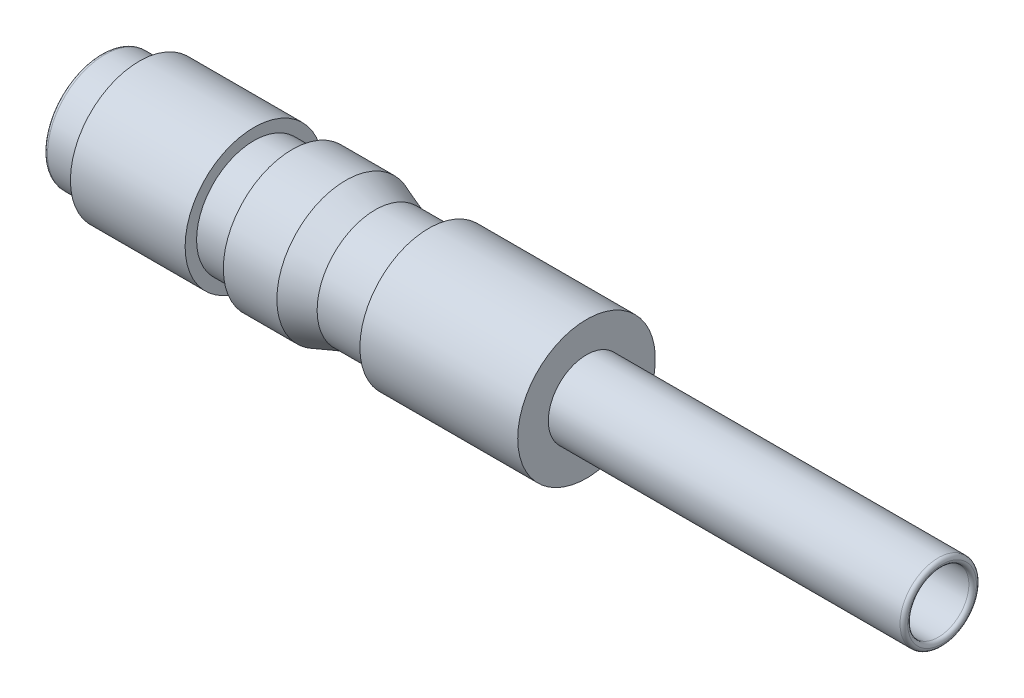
ISO-10303-21;
HEADER;
FILE_DESCRIPTION(('STEP AP214'),'2;1');
FILE_NAME('part.step','',(''),(''),'','','');
FILE_SCHEMA(('AUTOMOTIVE_DESIGN { 1 0 10303 214 1 1 1 1 }'));
ENDSEC;
DATA;
#1=APPLICATION_CONTEXT('core data for automotive mechanical design processes');
#2=APPLICATION_PROTOCOL_DEFINITION('international standard','automotive_design',2000,#1);
#3=PRODUCT_CONTEXT('',#1,'mechanical');
#4=PRODUCT('Part','Part','',(#3));
#5=PRODUCT_RELATED_PRODUCT_CATEGORY('part','',(#4));
#6=PRODUCT_DEFINITION_FORMATION('','',#4);
#7=PRODUCT_DEFINITION_CONTEXT('part definition',#1,'design');
#8=PRODUCT_DEFINITION('design','',#6,#7);
#9=PRODUCT_DEFINITION_SHAPE('','',#8);
#10=(LENGTH_UNIT() NAMED_UNIT(*) SI_UNIT(.MILLI.,.METRE.));
#11=(NAMED_UNIT(*) PLANE_ANGLE_UNIT() SI_UNIT($,.RADIAN.));
#12=(NAMED_UNIT(*) SI_UNIT($,.STERADIAN.) SOLID_ANGLE_UNIT());
#13=UNCERTAINTY_MEASURE_WITH_UNIT(LENGTH_MEASURE(1.E-05),#10,'distance_accuracy_value','');
#14=(GEOMETRIC_REPRESENTATION_CONTEXT(3) GLOBAL_UNCERTAINTY_ASSIGNED_CONTEXT((#13)) GLOBAL_UNIT_ASSIGNED_CONTEXT((#10,
#11,#12)) REPRESENTATION_CONTEXT('',''));
#15=CARTESIAN_POINT('',(0.,0.,0.));
#16=DIRECTION('',(0.,0.,1.));
#17=DIRECTION('',(1.,0.,0.));
#18=AXIS2_PLACEMENT_3D('',#15,#16,#17);
#19=CARTESIAN_POINT('',(5.,0.,0.));
#20=DIRECTION('',(1.,0.,0.));
#21=DIRECTION('',(0.,0.,-1.));
#22=AXIS2_PLACEMENT_3D('',#19,#20,#21);
#23=CYLINDRICAL_SURFACE('',#22,0.4);
#24=CARTESIAN_POINT('',(10.95,0.,0.));
#25=DIRECTION('',(-1.,0.,0.));
#26=DIRECTION('',(0.,0.,1.));
#27=AXIS2_PLACEMENT_3D('',#24,#25,#26);
#28=CIRCLE('',#27,0.4);
#29=CARTESIAN_POINT('',(10.95,0.,0.4));
#30=VERTEX_POINT('',#29);
#31=EDGE_CURVE('E60',#30,#30,#28,.F.);
#32=ORIENTED_EDGE('',*,*,#31,.T.);
#33=EDGE_LOOP('',(#32));
#34=FACE_BOUND('',#33,.T.);
#35=CARTESIAN_POINT('',(6.,0.,0.));
#36=DIRECTION('',(-1.,0.,0.));
#37=DIRECTION('',(0.,0.,1.));
#38=AXIS2_PLACEMENT_3D('',#35,#36,#37);
#39=CIRCLE('',#38,0.4);
#40=CARTESIAN_POINT('',(6.,0.,0.4));
#41=VERTEX_POINT('',#40);
#42=EDGE_CURVE('E64',#41,#41,#39,.F.);
#43=ORIENTED_EDGE('',*,*,#42,.F.);
#44=EDGE_LOOP('',(#43));
#45=FACE_BOUND('',#44,.T.);
#46=ADVANCED_FACE('F33',(#34,#45),#23,.F.);
#47=CARTESIAN_POINT('',(0.,0.,0.));
#48=DIRECTION('',(1.,0.,0.));
#49=DIRECTION('',(0.,0.,-1.));
#50=AXIS2_PLACEMENT_3D('',#47,#48,#49);
#51=PLANE('',#50);
#52=CARTESIAN_POINT('',(0.,0.,0.));
#53=DIRECTION('',(1.,0.,0.));
#54=DIRECTION('',(0.,0.,-1.));
#55=AXIS2_PLACEMENT_3D('',#52,#53,#54);
#56=CIRCLE('',#55,0.699999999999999);
#57=CARTESIAN_POINT('',(0.,0.,-0.699999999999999));
#58=VERTEX_POINT('',#57);
#59=EDGE_CURVE('E40',#58,#58,#56,.F.);
#60=ORIENTED_EDGE('',*,*,#59,.T.);
#61=EDGE_LOOP('',(#60));
#62=FACE_BOUND('',#61,.T.);
#63=CARTESIAN_POINT('',(0.,0.,0.));
#64=DIRECTION('',(-1.,0.,0.));
#65=DIRECTION('',(0.,0.,1.));
#66=AXIS2_PLACEMENT_3D('',#63,#64,#65);
#67=CIRCLE('',#66,0.6);
#68=CARTESIAN_POINT('',(0.,0.,0.6));
#69=VERTEX_POINT('',#68);
#70=EDGE_CURVE('E57',#69,#69,#67,.T.);
#71=ORIENTED_EDGE('',*,*,#70,.F.);
#72=EDGE_LOOP('',(#71));
#73=FACE_BOUND('',#72,.T.);
#74=ADVANCED_FACE('F115',(#62,#73),#51,.F.);
#75=CARTESIAN_POINT('',(-4.99745454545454,0.,0.));
#76=DIRECTION('',(-1.,0.,0.));
#77=DIRECTION('',(0.,0.,1.));
#78=AXIS2_PLACEMENT_3D('',#75,#76,#77);
#79=CYLINDRICAL_SURFACE('',#78,0.749999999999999);
#80=CARTESIAN_POINT('',(0.0499999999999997,0.,0.));
#81=DIRECTION('',(1.,0.,0.));
#82=DIRECTION('',(0.,0.,-1.));
#83=AXIS2_PLACEMENT_3D('',#80,#81,#82);
#84=CIRCLE('',#83,0.749999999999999);
#85=CARTESIAN_POINT('',(0.0499999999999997,0.,-0.749999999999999));
#86=VERTEX_POINT('',#85);
#87=EDGE_CURVE('E10',#86,#86,#84,.T.);
#88=ORIENTED_EDGE('',*,*,#87,.T.);
#89=EDGE_LOOP('',(#88));
#90=FACE_BOUND('',#89,.T.);
#91=CARTESIAN_POINT('',(0.45,0.,0.));
#92=DIRECTION('',(1.,0.,0.));
#93=DIRECTION('',(0.,0.,-1.));
#94=AXIS2_PLACEMENT_3D('',#91,#92,#93);
#95=CIRCLE('',#94,0.749999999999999);
#96=CARTESIAN_POINT('',(0.45,0.,-0.749999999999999));
#97=VERTEX_POINT('',#96);
#98=EDGE_CURVE('E48',#97,#97,#95,.F.);
#99=ORIENTED_EDGE('',*,*,#98,.T.);
#100=EDGE_LOOP('',(#99));
#101=FACE_BOUND('',#100,.T.);
#102=ADVANCED_FACE('F117',(#90,#101),#79,.T.);
#103=CARTESIAN_POINT('',(0.5,0.749999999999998,0.));
#104=DIRECTION('',(1.,0.,0.));
#105=DIRECTION('',(0.,0.,-1.));
#106=AXIS2_PLACEMENT_3D('',#103,#104,#105);
#107=PLANE('',#106);
#108=CARTESIAN_POINT('',(0.5,0.,0.));
#109=DIRECTION('',(1.,0.,0.));
#110=DIRECTION('',(0.,0.,-1.));
#111=AXIS2_PLACEMENT_3D('',#108,#109,#110);
#112=CIRCLE('',#111,0.799999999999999);
#113=CARTESIAN_POINT('',(0.5,0.,-0.799999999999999));
#114=VERTEX_POINT('',#113);
#115=EDGE_CURVE('E44',#114,#114,#112,.T.);
#116=ORIENTED_EDGE('',*,*,#115,.T.);
#117=EDGE_LOOP('',(#116));
#118=FACE_BOUND('',#117,.T.);
#119=CARTESIAN_POINT('',(0.5,0.,0.));
#120=DIRECTION('',(-1.,0.,0.));
#121=DIRECTION('',(0.,0.,1.));
#122=AXIS2_PLACEMENT_3D('',#119,#120,#121);
#123=CIRCLE('',#122,0.899999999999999);
#124=CARTESIAN_POINT('',(0.5,0.,0.899999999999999));
#125=VERTEX_POINT('',#124);
#126=EDGE_CURVE('E63',#125,#125,#123,.T.);
#127=ORIENTED_EDGE('',*,*,#126,.T.);
#128=EDGE_LOOP('',(#127));
#129=FACE_BOUND('',#128,.T.);
#130=ADVANCED_FACE('F123',(#118,#129),#107,.F.);
#131=CARTESIAN_POINT('',(-4.99745454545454,0.,0.));
#132=DIRECTION('',(-1.,0.,0.));
#133=DIRECTION('',(0.,0.,1.));
#134=AXIS2_PLACEMENT_3D('',#131,#132,#133);
#135=CYLINDRICAL_SURFACE('',#134,0.899999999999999);
#136=ORIENTED_EDGE('',*,*,#126,.F.);
#137=EDGE_LOOP('',(#136));
#138=FACE_BOUND('',#137,.T.);
#139=CARTESIAN_POINT('',(2.,0.,0.));
#140=DIRECTION('',(-1.,0.,0.));
#141=DIRECTION('',(0.,0.,1.));
#142=AXIS2_PLACEMENT_3D('',#139,#140,#141);
#143=CIRCLE('',#142,0.899999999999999);
#144=CARTESIAN_POINT('',(2.,0.,0.899999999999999));
#145=VERTEX_POINT('',#144);
#146=EDGE_CURVE('E71',#145,#145,#143,.T.);
#147=ORIENTED_EDGE('',*,*,#146,.T.);
#148=EDGE_LOOP('',(#147));
#149=FACE_BOUND('',#148,.T.);
#150=ADVANCED_FACE('F149',(#138,#149),#135,.T.);
#151=CARTESIAN_POINT('',(2.,0.899999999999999,0.));
#152=DIRECTION('',(-1.,0.,0.));
#153=DIRECTION('',(0.,0.,1.));
#154=AXIS2_PLACEMENT_3D('',#151,#152,#153);
#155=PLANE('',#154);
#156=ORIENTED_EDGE('',*,*,#146,.F.);
#157=EDGE_LOOP('',(#156));
#158=FACE_BOUND('',#157,.T.);
#159=CARTESIAN_POINT('',(2.,0.,0.));
#160=DIRECTION('',(-1.,0.,0.));
#161=DIRECTION('',(0.,0.,1.));
#162=AXIS2_PLACEMENT_3D('',#159,#160,#161);
#163=CIRCLE('',#162,0.749999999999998);
#164=CARTESIAN_POINT('',(2.,0.,0.749999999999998));
#165=VERTEX_POINT('',#164);
#166=EDGE_CURVE('E74',#165,#165,#163,.T.);
#167=ORIENTED_EDGE('',*,*,#166,.T.);
#168=EDGE_LOOP('',(#167));
#169=FACE_BOUND('',#168,.T.);
#170=ADVANCED_FACE('F154',(#158,#169),#155,.F.);
#171=CARTESIAN_POINT('',(-4.99745454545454,0.,0.));
#172=DIRECTION('',(-1.,0.,0.));
#173=DIRECTION('',(0.,0.,1.));
#174=AXIS2_PLACEMENT_3D('',#171,#172,#173);
#175=CYLINDRICAL_SURFACE('',#174,0.749999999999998);
#176=ORIENTED_EDGE('',*,*,#166,.F.);
#177=EDGE_LOOP('',(#176));
#178=FACE_BOUND('',#177,.T.);
#179=CARTESIAN_POINT('',(2.5,0.,0.));
#180=DIRECTION('',(-1.,0.,0.));
#181=DIRECTION('',(0.,0.,1.));
#182=AXIS2_PLACEMENT_3D('',#179,#180,#181);
#183=CIRCLE('',#182,0.749999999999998);
#184=CARTESIAN_POINT('',(2.5,0.,0.749999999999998));
#185=VERTEX_POINT('',#184);
#186=EDGE_CURVE('E77',#185,#185,#183,.T.);
#187=ORIENTED_EDGE('',*,*,#186,.T.);
#188=EDGE_LOOP('',(#187));
#189=FACE_BOUND('',#188,.T.);
#190=ADVANCED_FACE('F160',(#178,#189),#175,.T.);
#191=CARTESIAN_POINT('',(2.5,0.749999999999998,0.));
#192=DIRECTION('',(1.,0.,0.));
#193=DIRECTION('',(0.,0.,-1.));
#194=AXIS2_PLACEMENT_3D('',#191,#192,#193);
#195=PLANE('',#194);
#196=ORIENTED_EDGE('',*,*,#186,.F.);
#197=EDGE_LOOP('',(#196));
#198=FACE_BOUND('',#197,.T.);
#199=CARTESIAN_POINT('',(2.5,0.,0.));
#200=DIRECTION('',(-1.,0.,0.));
#201=DIRECTION('',(0.,0.,1.));
#202=AXIS2_PLACEMENT_3D('',#199,#200,#201);
#203=CIRCLE('',#202,0.899999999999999);
#204=CARTESIAN_POINT('',(2.5,0.,0.899999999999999));
#205=VERTEX_POINT('',#204);
#206=EDGE_CURVE('E80',#205,#205,#203,.T.);
#207=ORIENTED_EDGE('',*,*,#206,.T.);
#208=EDGE_LOOP('',(#207));
#209=FACE_BOUND('',#208,.T.);
#210=ADVANCED_FACE('F166',(#198,#209),#195,.F.);
#211=CARTESIAN_POINT('',(-4.99745454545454,0.,0.));
#212=DIRECTION('',(-1.,0.,0.));
#213=DIRECTION('',(0.,0.,1.));
#214=AXIS2_PLACEMENT_3D('',#211,#212,#213);
#215=CYLINDRICAL_SURFACE('',#214,0.899999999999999);
#216=ORIENTED_EDGE('',*,*,#206,.F.);
#217=EDGE_LOOP('',(#216));
#218=FACE_BOUND('',#217,.T.);
#219=CARTESIAN_POINT('',(3.2,0.,0.));
#220=DIRECTION('',(-1.,0.,0.));
#221=DIRECTION('',(0.,0.,1.));
#222=AXIS2_PLACEMENT_3D('',#219,#220,#221);
#223=CIRCLE('',#222,0.899999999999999);
#224=CARTESIAN_POINT('',(3.2,0.,0.899999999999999));
#225=VERTEX_POINT('',#224);
#226=EDGE_CURVE('E83',#225,#225,#223,.T.);
#227=ORIENTED_EDGE('',*,*,#226,.T.);
#228=EDGE_LOOP('',(#227));
#229=FACE_BOUND('',#228,.T.);
#230=ADVANCED_FACE('F172',(#218,#229),#215,.T.);
#231=CARTESIAN_POINT('',(3.58601099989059,0.,0.));
#232=DIRECTION('',(-1.,0.,0.));
#233=DIRECTION('',(0.,0.,1.));
#234=AXIS2_PLACEMENT_3D('',#231,#232,#233);
#235=CONICAL_SURFACE('',#234,0.75950348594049,0.349065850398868);
#236=ORIENTED_EDGE('',*,*,#226,.F.);
#237=EDGE_LOOP('',(#236));
#238=FACE_BOUND('',#237,.T.);
#239=CARTESIAN_POINT('',(3.58601099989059,0.,0.));
#240=DIRECTION('',(-1.,0.,0.));
#241=DIRECTION('',(0.,0.,1.));
#242=AXIS2_PLACEMENT_3D('',#239,#240,#241);
#243=CIRCLE('',#242,0.75950348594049);
#244=CARTESIAN_POINT('',(3.58601099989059,0.,0.75950348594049));
#245=VERTEX_POINT('',#244);
#246=EDGE_CURVE('E86',#245,#245,#243,.T.);
#247=ORIENTED_EDGE('',*,*,#246,.T.);
#248=EDGE_LOOP('',(#247));
#249=FACE_BOUND('',#248,.T.);
#250=ADVANCED_FACE('F178',(#238,#249),#235,.T.);
#251=CARTESIAN_POINT('',(-4.99745454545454,0.,0.));
#252=DIRECTION('',(-1.,0.,0.));
#253=DIRECTION('',(0.,0.,1.));
#254=AXIS2_PLACEMENT_3D('',#251,#252,#253);
#255=CYLINDRICAL_SURFACE('',#254,0.75950348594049);
#256=ORIENTED_EDGE('',*,*,#246,.F.);
#257=EDGE_LOOP('',(#256));
#258=FACE_BOUND('',#257,.T.);
#259=CARTESIAN_POINT('',(4.28601099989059,0.,0.));
#260=DIRECTION('',(-1.,0.,0.));
#261=DIRECTION('',(0.,0.,1.));
#262=AXIS2_PLACEMENT_3D('',#259,#260,#261);
#263=CIRCLE('',#262,0.75950348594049);
#264=CARTESIAN_POINT('',(4.28601099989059,0.,0.75950348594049));
#265=VERTEX_POINT('',#264);
#266=EDGE_CURVE('E89',#265,#265,#263,.T.);
#267=ORIENTED_EDGE('',*,*,#266,.T.);
#268=EDGE_LOOP('',(#267));
#269=FACE_BOUND('',#268,.T.);
#270=ADVANCED_FACE('F184',(#258,#269),#255,.T.);
#271=CARTESIAN_POINT('',(4.28601099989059,0.75950348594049,0.));
#272=DIRECTION('',(1.,0.,0.));
#273=DIRECTION('',(0.,0.,-1.));
#274=AXIS2_PLACEMENT_3D('',#271,#272,#273);
#275=PLANE('',#274);
#276=ORIENTED_EDGE('',*,*,#266,.F.);
#277=EDGE_LOOP('',(#276));
#278=FACE_BOUND('',#277,.T.);
#279=CARTESIAN_POINT('',(4.28601099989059,0.,0.));
#280=DIRECTION('',(-1.,0.,0.));
#281=DIRECTION('',(0.,0.,1.));
#282=AXIS2_PLACEMENT_3D('',#279,#280,#281);
#283=CIRCLE('',#282,0.899999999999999);
#284=CARTESIAN_POINT('',(4.28601099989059,0.,0.899999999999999));
#285=VERTEX_POINT('',#284);
#286=EDGE_CURVE('E92',#285,#285,#283,.T.);
#287=ORIENTED_EDGE('',*,*,#286,.T.);
#288=EDGE_LOOP('',(#287));
#289=FACE_BOUND('',#288,.T.);
#290=ADVANCED_FACE('F190',(#278,#289),#275,.F.);
#291=CARTESIAN_POINT('',(-4.99745454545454,0.,0.));
#292=DIRECTION('',(-1.,0.,0.));
#293=DIRECTION('',(0.,0.,1.));
#294=AXIS2_PLACEMENT_3D('',#291,#292,#293);
#295=CYLINDRICAL_SURFACE('',#294,0.899999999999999);
#296=ORIENTED_EDGE('',*,*,#286,.F.);
#297=EDGE_LOOP('',(#296));
#298=FACE_BOUND('',#297,.T.);
#299=CARTESIAN_POINT('',(6.35,0.,0.));
#300=DIRECTION('',(-1.,0.,0.));
#301=DIRECTION('',(0.,0.,1.));
#302=AXIS2_PLACEMENT_3D('',#299,#300,#301);
#303=CIRCLE('',#302,0.899999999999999);
#304=CARTESIAN_POINT('',(6.35,0.,0.899999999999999));
#305=VERTEX_POINT('',#304);
#306=EDGE_CURVE('E95',#305,#305,#303,.T.);
#307=ORIENTED_EDGE('',*,*,#306,.T.);
#308=EDGE_LOOP('',(#307));
#309=FACE_BOUND('',#308,.T.);
#310=ADVANCED_FACE('F196',(#298,#309),#295,.T.);
#311=CARTESIAN_POINT('',(6.35,0.899999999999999,0.));
#312=DIRECTION('',(-1.,0.,0.));
#313=DIRECTION('',(0.,0.,1.));
#314=AXIS2_PLACEMENT_3D('',#311,#312,#313);
#315=PLANE('',#314);
#316=ORIENTED_EDGE('',*,*,#306,.F.);
#317=EDGE_LOOP('',(#316));
#318=FACE_BOUND('',#317,.T.);
#319=CARTESIAN_POINT('',(6.35,0.,0.));
#320=DIRECTION('',(-1.,0.,0.));
#321=DIRECTION('',(0.,0.,1.));
#322=AXIS2_PLACEMENT_3D('',#319,#320,#321);
#323=CIRCLE('',#322,0.499999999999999);
#324=CARTESIAN_POINT('',(6.35,0.,0.499999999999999));
#325=VERTEX_POINT('',#324);
#326=EDGE_CURVE('E67',#325,#325,#323,.T.);
#327=ORIENTED_EDGE('',*,*,#326,.T.);
#328=EDGE_LOOP('',(#327));
#329=FACE_BOUND('',#328,.T.);
#330=ADVANCED_FACE('F202',(#318,#329),#315,.F.);
#331=CARTESIAN_POINT('',(-4.99745454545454,0.,0.));
#332=DIRECTION('',(-1.,0.,0.));
#333=DIRECTION('',(0.,0.,1.));
#334=AXIS2_PLACEMENT_3D('',#331,#332,#333);
#335=CYLINDRICAL_SURFACE('',#334,0.499999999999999);
#336=CARTESIAN_POINT('',(10.95,0.,0.));
#337=DIRECTION('',(-1.,0.,0.));
#338=DIRECTION('',(0.,0.,1.));
#339=AXIS2_PLACEMENT_3D('',#336,#337,#338);
#340=CIRCLE('',#339,0.499999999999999);
#341=CARTESIAN_POINT('',(10.95,0.,0.499999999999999));
#342=VERTEX_POINT('',#341);
#343=EDGE_CURVE('E53',#342,#342,#340,.T.);
#344=ORIENTED_EDGE('',*,*,#343,.T.);
#345=EDGE_LOOP('',(#344));
#346=FACE_BOUND('',#345,.T.);
#347=ORIENTED_EDGE('',*,*,#326,.F.);
#348=EDGE_LOOP('',(#347));
#349=FACE_BOUND('',#348,.T.);
#350=ADVANCED_FACE('F208',(#346,#349),#335,.T.);
#351=CARTESIAN_POINT('',(6.,0.,0.));
#352=DIRECTION('',(-1.,0.,0.));
#353=DIRECTION('',(0.,0.,1.));
#354=AXIS2_PLACEMENT_3D('',#351,#352,#353);
#355=PLANE('',#354);
#356=CARTESIAN_POINT('',(6.,0.,0.));
#357=DIRECTION('',(-1.,0.,0.));
#358=DIRECTION('',(0.,0.,1.));
#359=AXIS2_PLACEMENT_3D('',#356,#357,#358);
#360=CIRCLE('',#359,0.6);
#361=CARTESIAN_POINT('',(6.,0.,0.6));
#362=VERTEX_POINT('',#361);
#363=EDGE_CURVE('E68',#362,#362,#360,.T.);
#364=ORIENTED_EDGE('',*,*,#363,.T.);
#365=EDGE_LOOP('',(#364));
#366=FACE_BOUND('',#365,.T.);
#367=ORIENTED_EDGE('',*,*,#42,.T.);
#368=EDGE_LOOP('',(#367));
#369=FACE_BOUND('',#368,.T.);
#370=ADVANCED_FACE('F105',(#366,#369),#355,.T.);
#371=CARTESIAN_POINT('',(6.,0.,0.));
#372=DIRECTION('',(-1.,0.,0.));
#373=DIRECTION('',(0.,0.,1.));
#374=AXIS2_PLACEMENT_3D('',#371,#372,#373);
#375=CYLINDRICAL_SURFACE('',#374,0.6);
#376=ORIENTED_EDGE('',*,*,#363,.F.);
#377=EDGE_LOOP('',(#376));
#378=FACE_BOUND('',#377,.T.);
#379=ORIENTED_EDGE('',*,*,#70,.T.);
#380=EDGE_LOOP('',(#379));
#381=FACE_BOUND('',#380,.T.);
#382=ADVANCED_FACE('F108',(#378,#381),#375,.F.);
#383=CARTESIAN_POINT('',(10.95,0.,0.));
#384=DIRECTION('',(-1.,0.,0.));
#385=DIRECTION('',(0.,0.,1.));
#386=AXIS2_PLACEMENT_3D('',#383,#384,#385);
#387=TOROIDAL_SURFACE('',#386,0.449999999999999,0.05);
#388=ORIENTED_EDGE('',*,*,#343,.F.);
#389=EDGE_LOOP('',(#388));
#390=FACE_BOUND('',#389,.T.);
#391=CARTESIAN_POINT('',(11.,0.,0.));
#392=DIRECTION('',(-1.,0.,0.));
#393=DIRECTION('',(0.,0.,1.));
#394=AXIS2_PLACEMENT_3D('',#391,#392,#393);
#395=CIRCLE('',#394,0.449999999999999);
#396=CARTESIAN_POINT('',(11.,0.,0.449999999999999));
#397=VERTEX_POINT('',#396);
#398=EDGE_CURVE('E54',#397,#397,#395,.F.);
#399=ORIENTED_EDGE('',*,*,#398,.F.);
#400=EDGE_LOOP('',(#399));
#401=FACE_BOUND('',#400,.T.);
#402=ADVANCED_FACE('F111',(#390,#401),#387,.T.);
#403=CARTESIAN_POINT('',(10.95,0.,0.));
#404=DIRECTION('',(-1.,0.,0.));
#405=DIRECTION('',(0.,0.,1.));
#406=AXIS2_PLACEMENT_3D('',#403,#404,#405);
#407=TOROIDAL_SURFACE('',#406,0.45,0.05);
#408=ORIENTED_EDGE('',*,*,#398,.T.);
#409=EDGE_LOOP('',(#408));
#410=FACE_BOUND('',#409,.T.);
#411=ORIENTED_EDGE('',*,*,#31,.F.);
#412=EDGE_LOOP('',(#411));
#413=FACE_BOUND('',#412,.T.);
#414=ADVANCED_FACE('F129',(#410,#413),#407,.T.);
#415=CARTESIAN_POINT('',(0.45,0.,0.));
#416=DIRECTION('',(1.,0.,0.));
#417=DIRECTION('',(0.,0.,-1.));
#418=AXIS2_PLACEMENT_3D('',#415,#416,#417);
#419=TOROIDAL_SURFACE('',#418,0.799999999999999,0.05);
#420=ORIENTED_EDGE('',*,*,#115,.F.);
#421=EDGE_LOOP('',(#420));
#422=FACE_BOUND('',#421,.T.);
#423=ORIENTED_EDGE('',*,*,#98,.F.);
#424=EDGE_LOOP('',(#423));
#425=FACE_BOUND('',#424,.T.);
#426=ADVANCED_FACE('F132',(#422,#425),#419,.F.);
#427=CARTESIAN_POINT('',(0.0499999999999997,0.,0.));
#428=DIRECTION('',(1.,0.,0.));
#429=DIRECTION('',(0.,0.,-1.));
#430=AXIS2_PLACEMENT_3D('',#427,#428,#429);
#431=TOROIDAL_SURFACE('',#430,0.699999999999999,0.05);
#432=ORIENTED_EDGE('',*,*,#87,.F.);
#433=EDGE_LOOP('',(#432));
#434=FACE_BOUND('',#433,.T.);
#435=ORIENTED_EDGE('',*,*,#59,.F.);
#436=EDGE_LOOP('',(#435));
#437=FACE_BOUND('',#436,.T.);
#438=ADVANCED_FACE('F35',(#434,#437),#431,.T.);
#439=CLOSED_SHELL('',(#46,#74,#102,#130,#150,#170,#190,#210,#230,#250,#270,#290,#310,#330,#350,
#370,#382,#402,#414,#426,#438));
#440=MANIFOLD_SOLID_BREP('B2',#439);
#441=ADVANCED_BREP_SHAPE_REPRESENTATION('',(#18,#440),#14);
#442=SHAPE_DEFINITION_REPRESENTATION(#9,#441);
ENDSEC;
END-ISO-10303-21;
